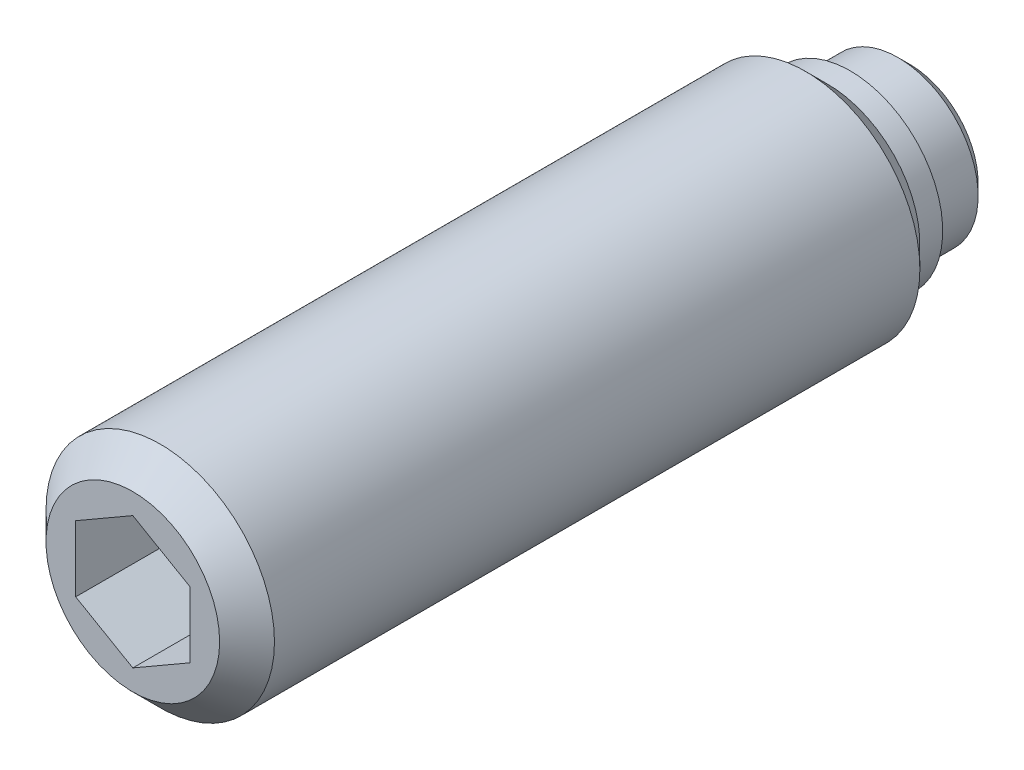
ISO-10303-21;
HEADER;
FILE_DESCRIPTION(('STEP AP214'),'2;1');
FILE_NAME('part.step','',(''),(''),'','','');
FILE_SCHEMA(('AUTOMOTIVE_DESIGN { 1 0 10303 214 1 1 1 1 }'));
ENDSEC;
DATA;
#1=APPLICATION_CONTEXT('core data for automotive mechanical design processes');
#2=APPLICATION_PROTOCOL_DEFINITION('international standard','automotive_design',2000,#1);
#3=PRODUCT_CONTEXT('',#1,'mechanical');
#4=PRODUCT('Part','Part','',(#3));
#5=PRODUCT_RELATED_PRODUCT_CATEGORY('part','',(#4));
#6=PRODUCT_DEFINITION_FORMATION('','',#4);
#7=PRODUCT_DEFINITION_CONTEXT('part definition',#1,'design');
#8=PRODUCT_DEFINITION('design','',#6,#7);
#9=PRODUCT_DEFINITION_SHAPE('','',#8);
#10=(LENGTH_UNIT() NAMED_UNIT(*) SI_UNIT(.MILLI.,.METRE.));
#11=(NAMED_UNIT(*) PLANE_ANGLE_UNIT() SI_UNIT($,.RADIAN.));
#12=(NAMED_UNIT(*) SI_UNIT($,.STERADIAN.) SOLID_ANGLE_UNIT());
#13=UNCERTAINTY_MEASURE_WITH_UNIT(LENGTH_MEASURE(1.E-05),#10,'distance_accuracy_value','');
#14=(GEOMETRIC_REPRESENTATION_CONTEXT(3) GLOBAL_UNCERTAINTY_ASSIGNED_CONTEXT((#13)) GLOBAL_UNIT_ASSIGNED_CONTEXT((#10,
#11,#12)) REPRESENTATION_CONTEXT('',''));
#15=CARTESIAN_POINT('',(0.,0.,0.));
#16=DIRECTION('',(0.,0.,1.));
#17=DIRECTION('',(1.,0.,0.));
#18=AXIS2_PLACEMENT_3D('',#15,#16,#17);
#19=CARTESIAN_POINT('',(0.,0.,2.6));
#20=DIRECTION('',(0.,0.,-1.));
#21=DIRECTION('',(-1.,0.,0.));
#22=AXIS2_PLACEMENT_3D('',#19,#20,#21);
#23=CYLINDRICAL_SURFACE('',#22,5.);
#24=CARTESIAN_POINT('',(0.,0.,32.8));
#25=DIRECTION('',(0.,0.,1.));
#26=DIRECTION('',(1.,0.,0.));
#27=AXIS2_PLACEMENT_3D('',#24,#25,#26);
#28=CIRCLE('',#27,5.);
#29=CARTESIAN_POINT('',(5.,0.,32.8));
#30=VERTEX_POINT('',#29);
#31=EDGE_CURVE('E9',#30,#30,#28,.F.);
#32=ORIENTED_EDGE('',*,*,#31,.T.);
#33=EDGE_LOOP('',(#32));
#34=FACE_BOUND('',#33,.T.);
#35=CARTESIAN_POINT('',(0.,0.,4.55));
#36=DIRECTION('',(0.,0.,-1.));
#37=DIRECTION('',(-1.,0.,0.));
#38=AXIS2_PLACEMENT_3D('',#35,#36,#37);
#39=CIRCLE('',#38,5.);
#40=CARTESIAN_POINT('',(-5.,0.,4.55));
#41=VERTEX_POINT('',#40);
#42=EDGE_CURVE('E74',#41,#41,#39,.T.);
#43=ORIENTED_EDGE('',*,*,#42,.F.);
#44=EDGE_LOOP('',(#43));
#45=FACE_BOUND('',#44,.T.);
#46=ADVANCED_FACE('F14',(#34,#45),#23,.T.);
#47=CARTESIAN_POINT('',(0.,0.,4.55));
#48=DIRECTION('',(0.,0.,1.));
#49=DIRECTION('',(1.,0.,0.));
#50=AXIS2_PLACEMENT_3D('',#47,#48,#49);
#51=CONICAL_SURFACE('',#50,5.,0.785398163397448);
#52=ORIENTED_EDGE('',*,*,#42,.T.);
#53=EDGE_LOOP('',(#52));
#54=FACE_BOUND('',#53,.T.);
#55=CARTESIAN_POINT('',(0.,0.,3.6));
#56=DIRECTION('',(0.,0.,-1.));
#57=DIRECTION('',(-1.,0.,0.));
#58=AXIS2_PLACEMENT_3D('',#55,#56,#57);
#59=CIRCLE('',#58,4.05);
#60=CARTESIAN_POINT('',(-4.05,0.,3.6));
#61=VERTEX_POINT('',#60);
#62=EDGE_CURVE('E112',#61,#61,#59,.T.);
#63=ORIENTED_EDGE('',*,*,#62,.F.);
#64=EDGE_LOOP('',(#63));
#65=FACE_BOUND('',#64,.T.);
#66=ADVANCED_FACE('F130',(#54,#65),#51,.T.);
#67=CARTESIAN_POINT('',(0.,0.,2.6));
#68=DIRECTION('',(0.,0.,-1.));
#69=DIRECTION('',(-1.,0.,0.));
#70=AXIS2_PLACEMENT_3D('',#67,#68,#69);
#71=CYLINDRICAL_SURFACE('',#70,4.05);
#72=ORIENTED_EDGE('',*,*,#62,.T.);
#73=EDGE_LOOP('',(#72));
#74=FACE_BOUND('',#73,.T.);
#75=CARTESIAN_POINT('',(0.,0.,2.6));
#76=DIRECTION('',(0.,0.,-1.));
#77=DIRECTION('',(-1.,0.,0.));
#78=AXIS2_PLACEMENT_3D('',#75,#76,#77);
#79=CIRCLE('',#78,4.05);
#80=CARTESIAN_POINT('',(-4.05,0.,2.6));
#81=VERTEX_POINT('',#80);
#82=EDGE_CURVE('E109',#81,#81,#79,.T.);
#83=ORIENTED_EDGE('',*,*,#82,.F.);
#84=EDGE_LOOP('',(#83));
#85=FACE_BOUND('',#84,.T.);
#86=ADVANCED_FACE('F135',(#74,#85),#71,.T.);
#87=CARTESIAN_POINT('',(0.,4.05,2.6));
#88=DIRECTION('',(0.,0.,1.));
#89=DIRECTION('',(1.,0.,0.));
#90=AXIS2_PLACEMENT_3D('',#87,#88,#89);
#91=PLANE('',#90);
#92=ORIENTED_EDGE('',*,*,#82,.T.);
#93=EDGE_LOOP('',(#92));
#94=FACE_BOUND('',#93,.T.);
#95=CARTESIAN_POINT('',(0.,0.,2.6));
#96=DIRECTION('',(0.,0.,-1.));
#97=DIRECTION('',(-1.,0.,0.));
#98=AXIS2_PLACEMENT_3D('',#95,#96,#97);
#99=CIRCLE('',#98,3.5);
#100=CARTESIAN_POINT('',(-3.5,0.,2.6));
#101=VERTEX_POINT('',#100);
#102=EDGE_CURVE('E106',#101,#101,#99,.T.);
#103=ORIENTED_EDGE('',*,*,#102,.F.);
#104=EDGE_LOOP('',(#103));
#105=FACE_BOUND('',#104,.T.);
#106=ADVANCED_FACE('F142',(#94,#105),#91,.F.);
#107=CARTESIAN_POINT('',(0.,0.,0.));
#108=DIRECTION('',(0.,0.,-1.));
#109=DIRECTION('',(-1.,0.,0.));
#110=AXIS2_PLACEMENT_3D('',#107,#108,#109);
#111=CYLINDRICAL_SURFACE('',#110,3.5);
#112=CARTESIAN_POINT('',(0.,0.,0.5));
#113=DIRECTION('',(0.,0.,-1.));
#114=DIRECTION('',(-1.,0.,0.));
#115=AXIS2_PLACEMENT_3D('',#112,#113,#114);
#116=CIRCLE('',#115,3.5);
#117=CARTESIAN_POINT('',(-3.5,0.,0.5));
#118=VERTEX_POINT('',#117);
#119=EDGE_CURVE('E103',#118,#118,#116,.T.);
#120=ORIENTED_EDGE('',*,*,#119,.F.);
#121=EDGE_LOOP('',(#120));
#122=FACE_BOUND('',#121,.T.);
#123=ORIENTED_EDGE('',*,*,#102,.T.);
#124=EDGE_LOOP('',(#123));
#125=FACE_BOUND('',#124,.T.);
#126=ADVANCED_FACE('F146',(#122,#125),#111,.T.);
#127=CARTESIAN_POINT('',(0.,0.,0.5));
#128=DIRECTION('',(0.,0.,1.));
#129=DIRECTION('',(1.,0.,0.));
#130=AXIS2_PLACEMENT_3D('',#127,#128,#129);
#131=CONICAL_SURFACE('',#130,3.5,0.785398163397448);
#132=CARTESIAN_POINT('',(0.,0.,0.));
#133=DIRECTION('',(0.,0.,-1.));
#134=DIRECTION('',(-1.,0.,0.));
#135=AXIS2_PLACEMENT_3D('',#132,#133,#134);
#136=CIRCLE('',#135,3.);
#137=CARTESIAN_POINT('',(-3.,0.,0.));
#138=VERTEX_POINT('',#137);
#139=EDGE_CURVE('E100',#138,#138,#136,.T.);
#140=ORIENTED_EDGE('',*,*,#139,.F.);
#141=EDGE_LOOP('',(#140));
#142=FACE_BOUND('',#141,.T.);
#143=ORIENTED_EDGE('',*,*,#119,.T.);
#144=EDGE_LOOP('',(#143));
#145=FACE_BOUND('',#144,.T.);
#146=ADVANCED_FACE('F150',(#142,#145),#131,.T.);
#147=CARTESIAN_POINT('',(0.,3.,0.));
#148=DIRECTION('',(0.,0.,1.));
#149=DIRECTION('',(1.,0.,0.));
#150=AXIS2_PLACEMENT_3D('',#147,#148,#149);
#151=PLANE('',#150);
#152=ORIENTED_EDGE('',*,*,#139,.T.);
#153=EDGE_LOOP('',(#152));
#154=FACE_BOUND('',#153,.T.);
#155=ADVANCED_FACE('F154',(#154),#151,.F.);
#156=CARTESIAN_POINT('',(0.,0.,34.));
#157=DIRECTION('',(0.,0.,1.));
#158=DIRECTION('',(1.,0.,0.));
#159=AXIS2_PLACEMENT_3D('',#156,#157,#158);
#160=PLANE('',#159);
#161=CARTESIAN_POINT('',(0.,0.,34.));
#162=DIRECTION('',(0.,0.,1.));
#163=DIRECTION('',(1.,0.,0.));
#164=AXIS2_PLACEMENT_3D('',#161,#162,#163);
#165=CIRCLE('',#164,3.8);
#166=CARTESIAN_POINT('',(3.8,0.,34.));
#167=VERTEX_POINT('',#166);
#168=EDGE_CURVE('E22',#167,#167,#165,.T.);
#169=ORIENTED_EDGE('',*,*,#168,.T.);
#170=EDGE_LOOP('',(#169));
#171=FACE_BOUND('',#170,.T.);
#172=DIRECTION('',(-0.866025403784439,0.5,0.));
#173=VECTOR('',#172,1.);
#174=CARTESIAN_POINT('',(-2.5,-1.44337567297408,34.));
#175=LINE('',#174,#173);
#176=CARTESIAN_POINT('',(0.,-2.88675134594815,34.));
#177=VERTEX_POINT('',#176);
#178=CARTESIAN_POINT('',(-2.5,-1.44337567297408,34.));
#179=VERTEX_POINT('',#178);
#180=EDGE_CURVE('E69',#177,#179,#175,.T.);
#181=ORIENTED_EDGE('',*,*,#180,.T.);
#182=DIRECTION('',(0.,1.,0.));
#183=VECTOR('',#182,1.);
#184=CARTESIAN_POINT('',(-2.5,1.44337567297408,34.));
#185=LINE('',#184,#183);
#186=CARTESIAN_POINT('',(-2.5,1.44337567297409,34.));
#187=VERTEX_POINT('',#186);
#188=EDGE_CURVE('E84',#179,#187,#185,.T.);
#189=ORIENTED_EDGE('',*,*,#188,.T.);
#190=DIRECTION('',(0.866025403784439,0.5,0.));
#191=VECTOR('',#190,1.);
#192=CARTESIAN_POINT('',(0.,2.88675134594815,34.));
#193=LINE('',#192,#191);
#194=CARTESIAN_POINT('',(0.,2.88675134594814,34.));
#195=VERTEX_POINT('',#194);
#196=EDGE_CURVE('E301',#187,#195,#193,.T.);
#197=ORIENTED_EDGE('',*,*,#196,.T.);
#198=DIRECTION('',(0.866025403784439,-0.5,0.));
#199=VECTOR('',#198,1.);
#200=CARTESIAN_POINT('',(2.5,1.44337567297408,34.));
#201=LINE('',#200,#199);
#202=CARTESIAN_POINT('',(2.5,1.44337567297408,34.));
#203=VERTEX_POINT('',#202);
#204=EDGE_CURVE('E298',#195,#203,#201,.T.);
#205=ORIENTED_EDGE('',*,*,#204,.T.);
#206=DIRECTION('',(0.,-1.,0.));
#207=VECTOR('',#206,1.);
#208=CARTESIAN_POINT('',(2.5,-1.44337567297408,34.));
#209=LINE('',#208,#207);
#210=CARTESIAN_POINT('',(2.5,-1.44337567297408,34.));
#211=VERTEX_POINT('',#210);
#212=EDGE_CURVE('E29',#203,#211,#209,.T.);
#213=ORIENTED_EDGE('',*,*,#212,.T.);
#214=DIRECTION('',(-0.866025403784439,-0.5,0.));
#215=VECTOR('',#214,1.);
#216=CARTESIAN_POINT('',(0.,-2.88675134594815,34.));
#217=LINE('',#216,#215);
#218=EDGE_CURVE('E66',#211,#177,#217,.T.);
#219=ORIENTED_EDGE('',*,*,#218,.T.);
#220=EDGE_LOOP('',(#181,#189,#197,#205,#213,#219));
#221=FACE_BOUND('',#220,.T.);
#222=ADVANCED_FACE('F68',(#171,#221),#160,.T.);
#223=CARTESIAN_POINT('',(0.,0.,28.));
#224=DIRECTION('',(0.,0.,1.));
#225=DIRECTION('',(1.,0.,0.));
#226=AXIS2_PLACEMENT_3D('',#223,#224,#225);
#227=PLANE('',#226);
#228=DIRECTION('',(0.,-1.,0.));
#229=VECTOR('',#228,1.);
#230=CARTESIAN_POINT('',(-2.5,1.44337567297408,28.));
#231=LINE('',#230,#229);
#232=CARTESIAN_POINT('',(-2.5,1.44337567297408,28.));
#233=VERTEX_POINT('',#232);
#234=CARTESIAN_POINT('',(-2.5,-1.44337567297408,28.));
#235=VERTEX_POINT('',#234);
#236=EDGE_CURVE('E83',#233,#235,#231,.T.);
#237=ORIENTED_EDGE('',*,*,#236,.T.);
#238=DIRECTION('',(0.866025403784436,-0.5,0.));
#239=VECTOR('',#238,1.);
#240=CARTESIAN_POINT('',(-2.5,-1.44337567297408,28.));
#241=LINE('',#240,#239);
#242=CARTESIAN_POINT('',(0.,-2.88675134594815,28.));
#243=VERTEX_POINT('',#242);
#244=EDGE_CURVE('E280',#235,#243,#241,.T.);
#245=ORIENTED_EDGE('',*,*,#244,.T.);
#246=DIRECTION('',(0.866025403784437,0.5,0.));
#247=VECTOR('',#246,1.);
#248=CARTESIAN_POINT('',(0.,-2.88675134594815,28.));
#249=LINE('',#248,#247);
#250=CARTESIAN_POINT('',(2.5,-1.44337567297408,28.));
#251=VERTEX_POINT('',#250);
#252=EDGE_CURVE('E88',#243,#251,#249,.T.);
#253=ORIENTED_EDGE('',*,*,#252,.T.);
#254=DIRECTION('',(0.,1.,0.));
#255=VECTOR('',#254,1.);
#256=CARTESIAN_POINT('',(2.5,-1.44337567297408,28.));
#257=LINE('',#256,#255);
#258=CARTESIAN_POINT('',(2.5,1.44337567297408,28.));
#259=VERTEX_POINT('',#258);
#260=EDGE_CURVE('E287',#251,#259,#257,.T.);
#261=ORIENTED_EDGE('',*,*,#260,.T.);
#262=DIRECTION('',(-0.866025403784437,0.5,0.));
#263=VECTOR('',#262,1.);
#264=CARTESIAN_POINT('',(2.5,1.44337567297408,28.));
#265=LINE('',#264,#263);
#266=CARTESIAN_POINT('',(0.,2.88675134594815,28.));
#267=VERTEX_POINT('',#266);
#268=EDGE_CURVE('E96',#259,#267,#265,.T.);
#269=ORIENTED_EDGE('',*,*,#268,.T.);
#270=DIRECTION('',(-0.866025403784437,-0.5,0.));
#271=VECTOR('',#270,1.);
#272=CARTESIAN_POINT('',(0.,2.88675134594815,28.));
#273=LINE('',#272,#271);
#274=EDGE_CURVE('E91',#267,#233,#273,.T.);
#275=ORIENTED_EDGE('',*,*,#274,.T.);
#276=EDGE_LOOP('',(#237,#245,#253,#261,#269,#275));
#277=FACE_BOUND('',#276,.T.);
#278=ADVANCED_FACE('F162',(#277),#227,.T.);
#279=CARTESIAN_POINT('',(0.,-2.88675134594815,31.));
#280=DIRECTION('',(0.5,-0.866025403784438,0.));
#281=DIRECTION('',(0.866025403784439,0.5,0.));
#282=AXIS2_PLACEMENT_3D('',#279,#280,#281);
#283=PLANE('',#282);
#284=ORIENTED_EDGE('',*,*,#218,.F.);
#285=DIRECTION('',(0.,0.,1.));
#286=VECTOR('',#285,1.);
#287=CARTESIAN_POINT('',(2.5,-1.44337567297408,31.));
#288=LINE('',#287,#286);
#289=EDGE_CURVE('E90',#251,#211,#288,.T.);
#290=ORIENTED_EDGE('',*,*,#289,.F.);
#291=ORIENTED_EDGE('',*,*,#252,.F.);
#292=DIRECTION('',(0.,0.,1.));
#293=VECTOR('',#292,1.);
#294=CARTESIAN_POINT('',(0.,-2.88675134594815,31.));
#295=LINE('',#294,#293);
#296=EDGE_CURVE('E80',#243,#177,#295,.T.);
#297=ORIENTED_EDGE('',*,*,#296,.T.);
#298=EDGE_LOOP('',(#284,#290,#291,#297));
#299=FACE_BOUND('',#298,.T.);
#300=ADVANCED_FACE('F86',(#299),#283,.F.);
#301=CARTESIAN_POINT('',(2.5,-1.44337567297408,31.));
#302=DIRECTION('',(1.,0.,0.));
#303=DIRECTION('',(0.,0.,-1.));
#304=AXIS2_PLACEMENT_3D('',#301,#302,#303);
#305=PLANE('',#304);
#306=ORIENTED_EDGE('',*,*,#212,.F.);
#307=DIRECTION('',(0.,0.,1.));
#308=VECTOR('',#307,1.);
#309=CARTESIAN_POINT('',(2.5,1.44337567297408,31.));
#310=LINE('',#309,#308);
#311=EDGE_CURVE('E93',#259,#203,#310,.T.);
#312=ORIENTED_EDGE('',*,*,#311,.F.);
#313=ORIENTED_EDGE('',*,*,#260,.F.);
#314=ORIENTED_EDGE('',*,*,#289,.T.);
#315=EDGE_LOOP('',(#306,#312,#313,#314));
#316=FACE_BOUND('',#315,.T.);
#317=ADVANCED_FACE('F161',(#316),#305,.F.);
#318=CARTESIAN_POINT('',(2.5,1.44337567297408,31.));
#319=DIRECTION('',(0.5,0.866025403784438,0.));
#320=DIRECTION('',(-0.866025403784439,0.5,0.));
#321=AXIS2_PLACEMENT_3D('',#318,#319,#320);
#322=PLANE('',#321);
#323=ORIENTED_EDGE('',*,*,#204,.F.);
#324=DIRECTION('',(0.,0.,1.));
#325=VECTOR('',#324,1.);
#326=CARTESIAN_POINT('',(0.,2.88675134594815,31.));
#327=LINE('',#326,#325);
#328=EDGE_CURVE('E293',#267,#195,#327,.T.);
#329=ORIENTED_EDGE('',*,*,#328,.F.);
#330=ORIENTED_EDGE('',*,*,#268,.F.);
#331=ORIENTED_EDGE('',*,*,#311,.T.);
#332=EDGE_LOOP('',(#323,#329,#330,#331));
#333=FACE_BOUND('',#332,.T.);
#334=ADVANCED_FACE('F165',(#333),#322,.F.);
#335=CARTESIAN_POINT('',(0.,2.88675134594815,31.));
#336=DIRECTION('',(-0.5,0.866025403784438,0.));
#337=DIRECTION('',(-0.866025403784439,-0.5,0.));
#338=AXIS2_PLACEMENT_3D('',#335,#336,#337);
#339=PLANE('',#338);
#340=ORIENTED_EDGE('',*,*,#196,.F.);
#341=DIRECTION('',(0.,0.,1.));
#342=VECTOR('',#341,1.);
#343=CARTESIAN_POINT('',(-2.5,1.44337567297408,31.));
#344=LINE('',#343,#342);
#345=EDGE_CURVE('E37',#233,#187,#344,.T.);
#346=ORIENTED_EDGE('',*,*,#345,.F.);
#347=ORIENTED_EDGE('',*,*,#274,.F.);
#348=ORIENTED_EDGE('',*,*,#328,.T.);
#349=EDGE_LOOP('',(#340,#346,#347,#348));
#350=FACE_BOUND('',#349,.T.);
#351=ADVANCED_FACE('F169',(#350),#339,.F.);
#352=CARTESIAN_POINT('',(-2.5,1.44337567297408,31.));
#353=DIRECTION('',(-1.,0.,0.));
#354=DIRECTION('',(0.,0.,1.));
#355=AXIS2_PLACEMENT_3D('',#352,#353,#354);
#356=PLANE('',#355);
#357=ORIENTED_EDGE('',*,*,#188,.F.);
#358=DIRECTION('',(0.,0.,1.));
#359=VECTOR('',#358,1.);
#360=CARTESIAN_POINT('',(-2.5,-1.44337567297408,31.));
#361=LINE('',#360,#359);
#362=EDGE_CURVE('E82',#235,#179,#361,.T.);
#363=ORIENTED_EDGE('',*,*,#362,.F.);
#364=ORIENTED_EDGE('',*,*,#236,.F.);
#365=ORIENTED_EDGE('',*,*,#345,.T.);
#366=EDGE_LOOP('',(#357,#363,#364,#365));
#367=FACE_BOUND('',#366,.T.);
#368=ADVANCED_FACE('F126',(#367),#356,.F.);
#369=CARTESIAN_POINT('',(-2.5,-1.44337567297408,31.));
#370=DIRECTION('',(-0.5,-0.866025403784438,0.));
#371=DIRECTION('',(0.866025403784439,-0.5,0.));
#372=AXIS2_PLACEMENT_3D('',#369,#370,#371);
#373=PLANE('',#372);
#374=ORIENTED_EDGE('',*,*,#180,.F.);
#375=ORIENTED_EDGE('',*,*,#296,.F.);
#376=ORIENTED_EDGE('',*,*,#244,.F.);
#377=ORIENTED_EDGE('',*,*,#362,.T.);
#378=EDGE_LOOP('',(#374,#375,#376,#377));
#379=FACE_BOUND('',#378,.T.);
#380=ADVANCED_FACE('F78',(#379),#373,.F.);
#381=CARTESIAN_POINT('',(0.,0.,34.));
#382=DIRECTION('',(0.,0.,-1.));
#383=DIRECTION('',(-1.,0.,0.));
#384=AXIS2_PLACEMENT_3D('',#381,#382,#383);
#385=CONICAL_SURFACE('',#384,3.8,0.785398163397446);
#386=ORIENTED_EDGE('',*,*,#31,.F.);
#387=EDGE_LOOP('',(#386));
#388=FACE_BOUND('',#387,.T.);
#389=ORIENTED_EDGE('',*,*,#168,.F.);
#390=EDGE_LOOP('',(#389));
#391=FACE_BOUND('',#390,.T.);
#392=ADVANCED_FACE('F16',(#388,#391),#385,.T.);
#393=CLOSED_SHELL('',(#46,#66,#86,#106,#126,#146,#155,#222,#278,#300,#317,#334,#351,#368,#380,#392));
#394=MANIFOLD_SOLID_BREP('B1',#393);
#395=ADVANCED_BREP_SHAPE_REPRESENTATION('',(#18,#394),#14);
#396=SHAPE_DEFINITION_REPRESENTATION(#9,#395);
ENDSEC;
END-ISO-10303-21;
